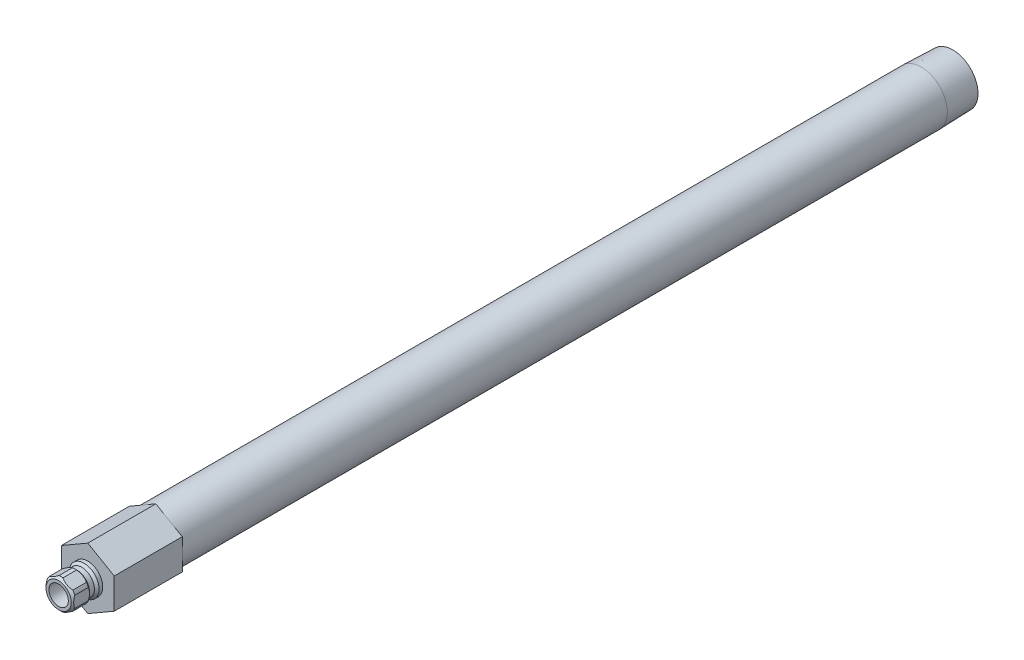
from build123d import *

# Parameters (mm, degrees)
SKETCH2_R           = 3.175
BOSS_EXTRUDE1_DEPTH = 22.225
CUT_EXTRUDE1_START  = 3.556
SKETCH3_OUTSIDE_W   = 77.93
SKETCH3_OUTSIDE_H   = 80.602
CUT_EXTRUDE1_DEPTH  = 280.326752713


with BuildPart() as part:
    # Sketch1 → Revolve1 (revolve)
    with BuildSketch(Plane(origin=(0, 0, 0), x_dir=(0, 0, -1), z_dir=(1, 0, 0))):
        Polygon((-9.525, 3.175), (-9.525, 4.1275), (-8.763, 4.8895), (-4.318, 4.8895), (-3.556, 4.1275), (-1.9685, 4.1275), (-1.2065, 4.8895), (0, 4.8895), (0, 8.5725), (272.2372, 8.5725), (282.575, 8.249445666), (282.575, 6.2611), (22.225, 6.2611), (22.225, 3.175), align=None)
    revolve(axis=Axis((0, 0, 0), (0, 0, 1)))

    # Sketch2 → Boss-Extrude1 (add)
    with BuildSketch(Plane.XY):
        Polygon((-8.636, 4.985996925), (-8.636, -4.985996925), (0, -9.971993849), (8.636, -4.985996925), (8.636, 4.985996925), (0, 9.971993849), align=None)
        with Locations(Location((0, 0, 0), (0, 0, 90))):
            Circle(SKETCH2_R, mode=Mode.SUBTRACT)
    extrude(amount=-BOSS_EXTRUDE1_DEPTH)

    # Sketch3 outside → Cut-Extrude1 (cut, through all)
    with BuildSketch(Plane.XY.offset(CUT_EXTRUDE1_START)):
        Rectangle(SKETCH3_OUTSIDE_W, SKETCH3_OUTSIDE_H)
        Polygon((4.5212, 2.610316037), (0, 5.220632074), (-4.5212, 2.610316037), (-4.5212, -2.610316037), (0, -5.220632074), (4.5212, -2.610316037), align=None, mode=Mode.SUBTRACT)
    extrude(amount=CUT_EXTRUDE1_DEPTH, mode=Mode.SUBTRACT)


solid = part.part
